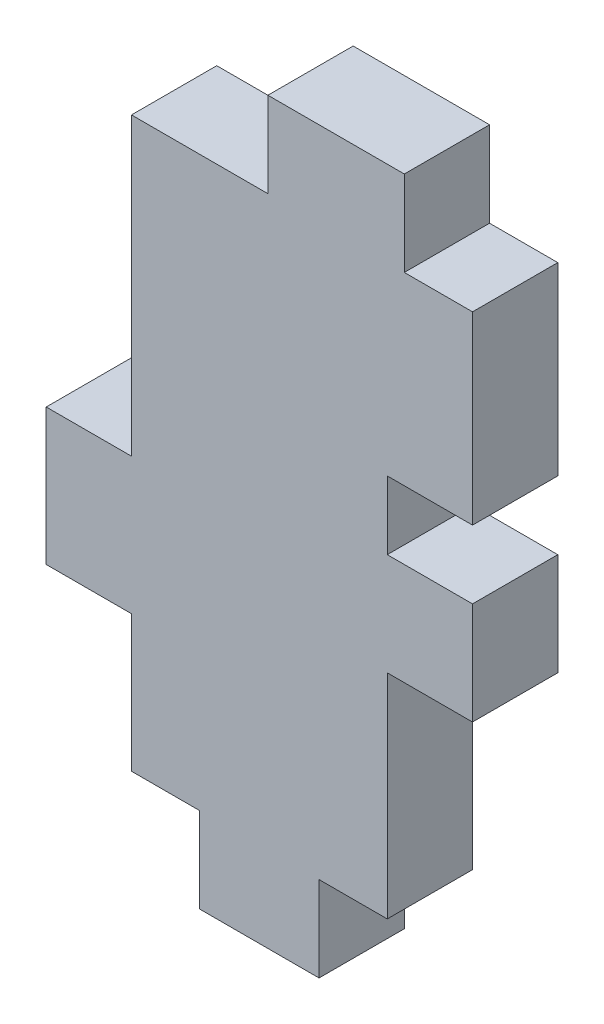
from build123d import *

# Parameters (mm, degrees)
SKETCH1_W           = 19.05
SKETCH1_H           = 42.333333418
SKETCH1_W_2         = 6.35
SKETCH1_H_2         = 7.62
BOSS_EXTRUDE2_DEPTH = 6.35
SKETCH3_W           = 8.89
SKETCH3_H           = 6.35
BOSS_EXTRUDE3_DEPTH = 6.35
SKETCH4_W           = 6.35
SKETCH4_H           = 13.758333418
BOSS_EXTRUDE4_DEPTH = 6.35
SKETCH5_W           = 6.35
SKETCH5_H           = 10.16
BOSS_EXTRUDE5_DEPTH = 6.35
SKETCH6_W           = 10.16
SKETCH6_H           = 6.35
BOSS_EXTRUDE6_DEPTH = 6.35


with BuildPart() as part:
    # Sketch1 → Boss-Extrude2 (new body)
    with BuildSketch(Plane.XY):
        with Locations((-9.525, 21.166666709)):
            Rectangle(SKETCH1_W, SKETCH1_H)
        with Locations((3.175, 19.685)):
            Rectangle(SKETCH1_W_2, SKETCH1_H_2)
    extrude(amount=BOSS_EXTRUDE2_DEPTH)

    # Sketch3 → Boss-Extrude3 (add)
    with BuildSketch(Plane.XZ):
        with Locations((-9.525, 3.175)):
            Rectangle(SKETCH3_W, SKETCH3_H)
    extrude(amount=BOSS_EXTRUDE3_DEPTH)

    # Sketch4 → Boss-Extrude4 (add)
    with BuildSketch(Plane(origin=(0, 0, 0), x_dir=(0, 0, -1), z_dir=(1, 0, 0))):
        with Locations((-3.175, 35.454166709)):
            Rectangle(SKETCH4_W, SKETCH4_H)
    extrude(amount=BOSS_EXTRUDE4_DEPTH)

    # Sketch5 → Boss-Extrude5 (add)
    with BuildSketch(Plane.ZY.offset(19.05)):
        with Locations((3.175, 15.24)):
            Rectangle(SKETCH5_W, SKETCH5_H)
    extrude(amount=BOSS_EXTRUDE5_DEPTH)

    # Sketch6 → Boss-Extrude6 (add)
    with BuildSketch(Plane(origin=(0, 42.333333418, 0), x_dir=(1, 0, 0), z_dir=(0, 1, 0))):
        with Locations((-3.81, -3.175)):
            Rectangle(SKETCH6_W, SKETCH6_H)
    extrude(amount=BOSS_EXTRUDE6_DEPTH)


solid = part.part
